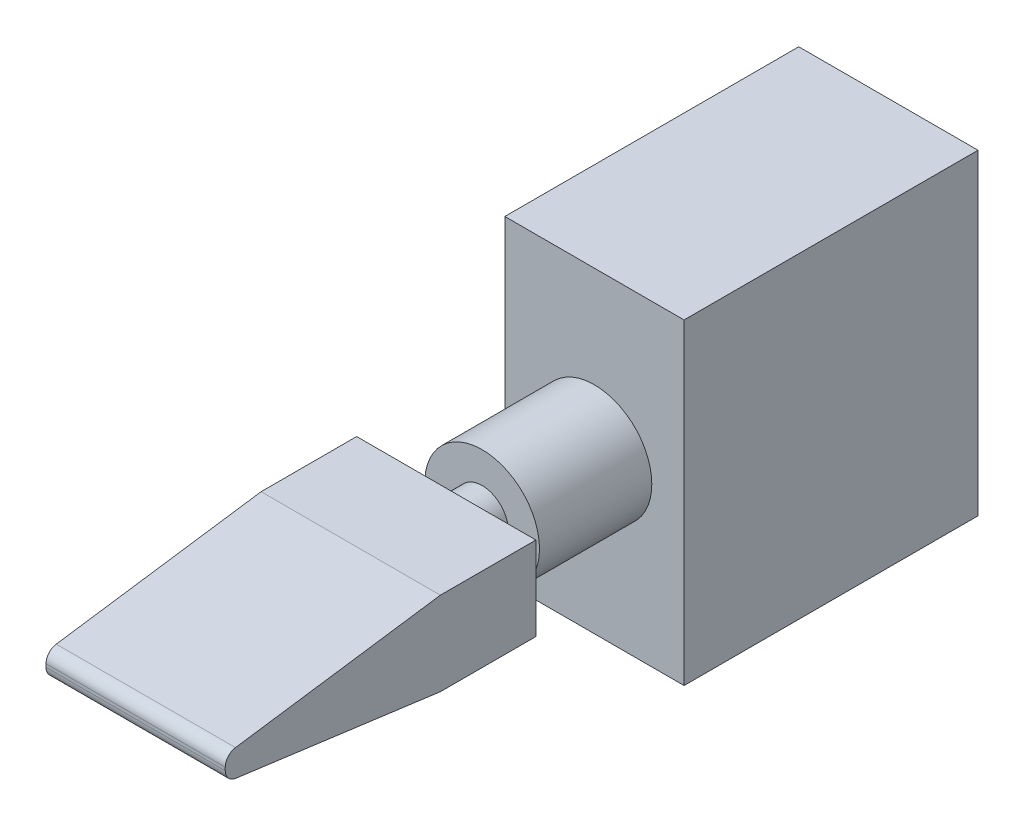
from build123d import *

# Parameters (mm, degrees)
SKETCH1_W           = 19.05
SKETCH1_H           = 33.655
BOSS_EXTRUDE1_DEPTH = 31.242
SKETCH2_R           = 6.096
BOSS_EXTRUDE2_DEPTH = 11.938
SKETCH3_R           = 2.794
BOSS_EXTRUDE3_DEPTH = 3.81
SKETCH4_W           = 19.05
SKETCH4_H           = 8.89
BOSS_EXTRUDE4_DEPTH = 33.02
CUT_EXTRUDE1_DEPTH  = 33.02


with BuildPart() as part:
    # Sketch1 → Boss-Extrude1 (new body)
    with BuildSketch(Plane.XY):
        Rectangle(SKETCH1_W, SKETCH1_H)
    extrude(amount=BOSS_EXTRUDE1_DEPTH)

    # Sketch2 → Boss-Extrude2 (add)
    with BuildSketch(Plane.XY.offset(31.242)):
        Circle(SKETCH2_R)
    extrude(amount=BOSS_EXTRUDE2_DEPTH)

    # Sketch3 → Boss-Extrude3 (add)
    with BuildSketch(Plane.XY.offset(43.18)):
        with Locations(Location((0, 0, 0), (0, 0, 180))):
            Circle(SKETCH3_R)
    extrude(amount=BOSS_EXTRUDE3_DEPTH)

    # Sketch4 → Boss-Extrude4 (add)
    with BuildSketch(Plane.XY.offset(46.99)):
        Rectangle(SKETCH4_W, SKETCH4_H)
    extrude(amount=BOSS_EXTRUDE4_DEPTH)

    # Sketch5 → Cut-Extrude1 (cut)
    with BuildSketch(Plane(origin=(9.525, 0, 0), x_dir=(0, 0, -1), z_dir=(1, 0, 0))):
        with BuildLine():
            Line((-80.01, 4.445), (-80.01, 0.045343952))
            ThreePointArc((-80.01, 0.045343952), (-79.700034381, 0.876748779), (-78.921442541, 1.30231595))
            Line((-78.921442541, 1.30231595), (-57.15, 4.445))
            Line((-57.15, 4.445), (-80.01, 4.445))
        make_face()
        with BuildLine():
            ThreePointArc((-78.907966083, -1.54185927), (-79.69556709, -1.119551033), (-80.01, -0.283015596))
            Line((-80.01, -0.283015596), (-80.01, -4.445))
            Line((-80.01, -4.445), (-57.15, -4.445))
            Line((-57.15, -4.445), (-78.907966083, -1.54185927))
        make_face()
    extrude(amount=-CUT_EXTRUDE1_DEPTH, mode=Mode.SUBTRACT)


solid = part.part
